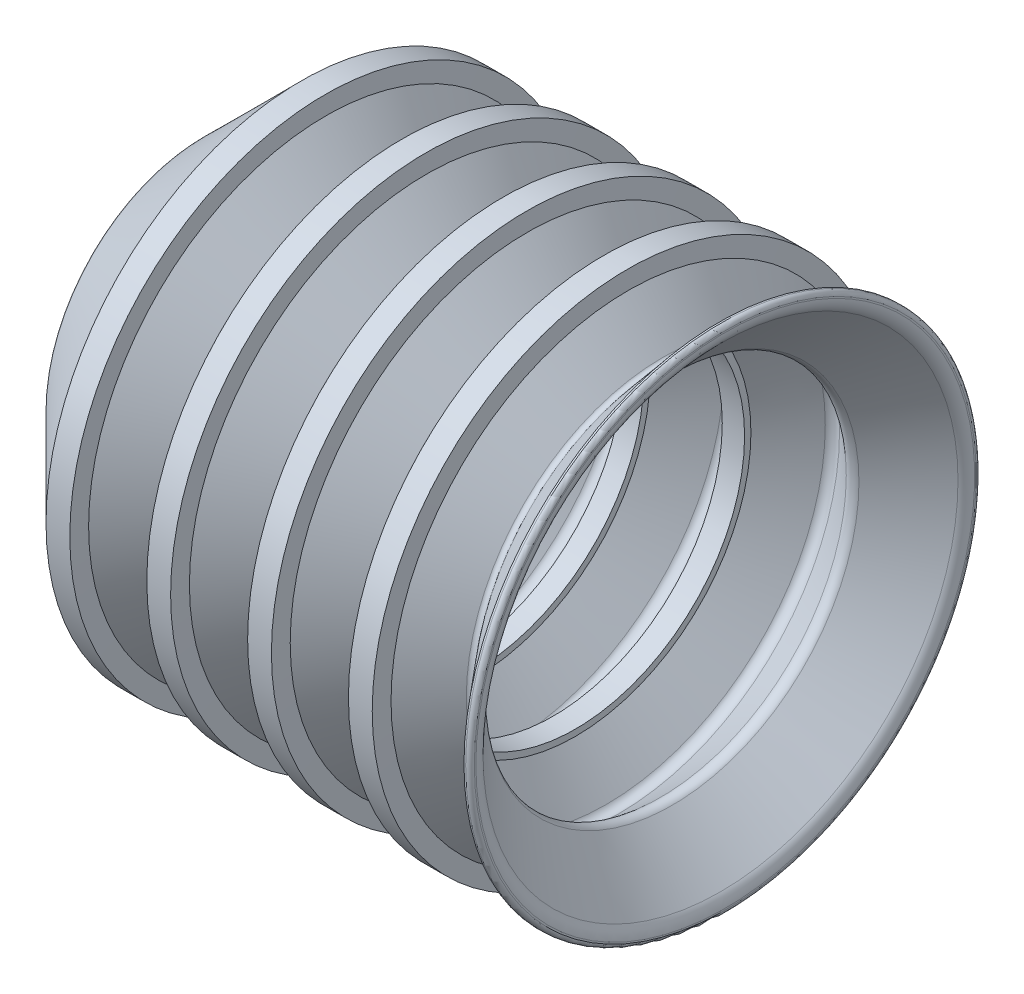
ISO-10303-21;
HEADER;
FILE_DESCRIPTION(('STEP AP214'),'2;1');
FILE_NAME('part.step','',(''),(''),'','','');
FILE_SCHEMA(('AUTOMOTIVE_DESIGN { 1 0 10303 214 1 1 1 1 }'));
ENDSEC;
DATA;
#1=APPLICATION_CONTEXT('core data for automotive mechanical design processes');
#2=APPLICATION_PROTOCOL_DEFINITION('international standard','automotive_design',2000,#1);
#3=PRODUCT_CONTEXT('',#1,'mechanical');
#4=PRODUCT('Part','Part','',(#3));
#5=PRODUCT_RELATED_PRODUCT_CATEGORY('part','',(#4));
#6=PRODUCT_DEFINITION_FORMATION('','',#4);
#7=PRODUCT_DEFINITION_CONTEXT('part definition',#1,'design');
#8=PRODUCT_DEFINITION('design','',#6,#7);
#9=PRODUCT_DEFINITION_SHAPE('','',#8);
#10=(LENGTH_UNIT() NAMED_UNIT(*) SI_UNIT(.MILLI.,.METRE.));
#11=(NAMED_UNIT(*) PLANE_ANGLE_UNIT() SI_UNIT($,.RADIAN.));
#12=(NAMED_UNIT(*) SI_UNIT($,.STERADIAN.) SOLID_ANGLE_UNIT());
#13=UNCERTAINTY_MEASURE_WITH_UNIT(LENGTH_MEASURE(1.E-05),#10,'distance_accuracy_value','');
#14=(GEOMETRIC_REPRESENTATION_CONTEXT(3) GLOBAL_UNCERTAINTY_ASSIGNED_CONTEXT((#13)) GLOBAL_UNIT_ASSIGNED_CONTEXT((#10,
#11,#12)) REPRESENTATION_CONTEXT('',''));
#15=CARTESIAN_POINT('',(0.,0.,0.));
#16=DIRECTION('',(0.,0.,1.));
#17=DIRECTION('',(1.,0.,0.));
#18=AXIS2_PLACEMENT_3D('',#15,#16,#17);
#19=CARTESIAN_POINT('',(30.861,14.732,0.));
#20=DIRECTION('',(-1.,0.,0.));
#21=DIRECTION('',(0.,0.,1.));
#22=AXIS2_PLACEMENT_3D('',#19,#20,#21);
#23=PLANE('',#22);
#24=CARTESIAN_POINT('',(30.861,0.,0.));
#25=DIRECTION('',(-1.,0.,0.));
#26=DIRECTION('',(0.,0.,1.));
#27=AXIS2_PLACEMENT_3D('',#24,#25,#26);
#28=CIRCLE('',#27,14.6428122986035);
#29=CARTESIAN_POINT('',(30.861,0.,14.6428122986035));
#30=VERTEX_POINT('',#29);
#31=EDGE_CURVE('E248',#30,#30,#28,.T.);
#32=ORIENTED_EDGE('',*,*,#31,.T.);
#33=EDGE_LOOP('',(#32));
#34=FACE_BOUND('',#33,.T.);
#35=CARTESIAN_POINT('',(30.861,0.,0.));
#36=DIRECTION('',(-1.,0.,0.));
#37=DIRECTION('',(0.,0.,1.));
#38=AXIS2_PLACEMENT_3D('',#35,#36,#37);
#39=CIRCLE('',#38,14.732);
#40=CARTESIAN_POINT('',(30.861,0.,14.732));
#41=VERTEX_POINT('',#40);
#42=EDGE_CURVE('E62',#41,#41,#39,.T.);
#43=ORIENTED_EDGE('',*,*,#42,.F.);
#44=EDGE_LOOP('',(#43));
#45=FACE_BOUND('',#44,.T.);
#46=ADVANCED_FACE('F14',(#34,#45),#23,.F.);
#47=CARTESIAN_POINT('',(30.607,0.,0.));
#48=DIRECTION('',(-1.,0.,0.));
#49=DIRECTION('',(0.,0.,1.));
#50=AXIS2_PLACEMENT_3D('',#47,#48,#49);
#51=TOROIDAL_SURFACE('',#50,14.732,0.254000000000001);
#52=CARTESIAN_POINT('',(30.607,0.,0.));
#53=DIRECTION('',(-1.,0.,0.));
#54=DIRECTION('',(0.,0.,1.));
#55=AXIS2_PLACEMENT_3D('',#52,#53,#54);
#56=CIRCLE('',#55,14.986);
#57=CARTESIAN_POINT('',(30.607,0.,14.986));
#58=VERTEX_POINT('',#57);
#59=EDGE_CURVE('E66',#58,#58,#56,.T.);
#60=ORIENTED_EDGE('',*,*,#59,.F.);
#61=EDGE_LOOP('',(#60));
#62=FACE_BOUND('',#61,.T.);
#63=ORIENTED_EDGE('',*,*,#42,.T.);
#64=EDGE_LOOP('',(#63));
#65=FACE_BOUND('',#64,.T.);
#66=ADVANCED_FACE('F307',(#62,#65),#51,.T.);
#67=CARTESIAN_POINT('',(0.,0.,0.));
#68=DIRECTION('',(-1.,0.,0.));
#69=DIRECTION('',(0.,0.,1.));
#70=AXIS2_PLACEMENT_3D('',#67,#68,#69);
#71=CYLINDRICAL_SURFACE('',#70,14.986);
#72=CARTESIAN_POINT('',(30.5054,0.,0.));
#73=DIRECTION('',(-1.,0.,0.));
#74=DIRECTION('',(0.,0.,1.));
#75=AXIS2_PLACEMENT_3D('',#72,#73,#74);
#76=CIRCLE('',#75,14.986);
#77=CARTESIAN_POINT('',(30.5054,0.,14.986));
#78=VERTEX_POINT('',#77);
#79=EDGE_CURVE('E70',#78,#78,#76,.T.);
#80=ORIENTED_EDGE('',*,*,#79,.F.);
#81=EDGE_LOOP('',(#80));
#82=FACE_BOUND('',#81,.T.);
#83=ORIENTED_EDGE('',*,*,#59,.T.);
#84=EDGE_LOOP('',(#83));
#85=FACE_BOUND('',#84,.T.);
#86=ADVANCED_FACE('F313',(#82,#85),#71,.T.);
#87=CARTESIAN_POINT('',(30.5054,0.,0.));
#88=DIRECTION('',(1.,0.,0.));
#89=DIRECTION('',(0.,0.,-1.));
#90=AXIS2_PLACEMENT_3D('',#87,#88,#89);
#91=CONICAL_SURFACE('',#90,14.986,0.867428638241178);
#92=CARTESIAN_POINT('',(27.5729883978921,0.,0.));
#93=DIRECTION('',(1.,0.,0.));
#94=DIRECTION('',(0.,0.,-1.));
#95=AXIS2_PLACEMENT_3D('',#92,#93,#94);
#96=CIRCLE('',#95,11.5282189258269);
#97=CARTESIAN_POINT('',(27.5729883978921,0.,-11.5282189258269));
#98=VERTEX_POINT('',#97);
#99=EDGE_CURVE('E54',#98,#98,#96,.T.);
#100=ORIENTED_EDGE('',*,*,#99,.T.);
#101=EDGE_LOOP('',(#100));
#102=FACE_BOUND('',#101,.T.);
#103=ORIENTED_EDGE('',*,*,#79,.T.);
#104=EDGE_LOOP('',(#103));
#105=FACE_BOUND('',#104,.T.);
#106=ADVANCED_FACE('F360',(#102,#105),#91,.T.);
#107=CARTESIAN_POINT('',(27.3792706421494,0.,0.));
#108=DIRECTION('',(-1.,0.,0.));
#109=DIRECTION('',(0.,0.,1.));
#110=AXIS2_PLACEMENT_3D('',#107,#108,#109);
#111=CONICAL_SURFACE('',#110,11.2997947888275,0.867428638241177);
#112=CARTESIAN_POINT('',(27.1855528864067,0.,0.));
#113=DIRECTION('',(-1.,0.,0.));
#114=DIRECTION('',(0.,0.,1.));
#115=AXIS2_PLACEMENT_3D('',#112,#113,#114);
#116=CIRCLE('',#115,11.5282189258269);
#117=CARTESIAN_POINT('',(27.1855528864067,0.,11.5282189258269));
#118=VERTEX_POINT('',#117);
#119=EDGE_CURVE('E58',#118,#118,#116,.T.);
#120=ORIENTED_EDGE('',*,*,#119,.T.);
#121=EDGE_LOOP('',(#120));
#122=FACE_BOUND('',#121,.T.);
#123=CARTESIAN_POINT('',(25.1578534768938,0.,0.));
#124=DIRECTION('',(-1.,0.,0.));
#125=DIRECTION('',(0.,0.,1.));
#126=AXIS2_PLACEMENT_3D('',#123,#124,#125);
#127=CIRCLE('',#126,13.9192);
#128=CARTESIAN_POINT('',(25.1578534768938,0.,13.9192));
#129=VERTEX_POINT('',#128);
#130=EDGE_CURVE('E74',#129,#129,#127,.T.);
#131=ORIENTED_EDGE('',*,*,#130,.F.);
#132=EDGE_LOOP('',(#131));
#133=FACE_BOUND('',#132,.T.);
#134=ADVANCED_FACE('F356',(#122,#133),#111,.T.);
#135=CARTESIAN_POINT('',(25.1578534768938,0.,0.));
#136=DIRECTION('',(-1.,0.,0.));
#137=DIRECTION('',(0.,0.,1.));
#138=AXIS2_PLACEMENT_3D('',#135,#136,#137);
#139=CONICAL_SURFACE('',#138,13.9192,1.53588974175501);
#140=CARTESIAN_POINT('',(25.1206,0.,0.));
#141=DIRECTION('',(-1.,0.,0.));
#142=DIRECTION('',(0.,0.,1.));
#143=AXIS2_PLACEMENT_3D('',#140,#141,#142);
#144=CIRCLE('',#143,14.986);
#145=CARTESIAN_POINT('',(25.1206,0.,14.986));
#146=VERTEX_POINT('',#145);
#147=EDGE_CURVE('E77',#146,#146,#144,.T.);
#148=ORIENTED_EDGE('',*,*,#147,.F.);
#149=EDGE_LOOP('',(#148));
#150=FACE_BOUND('',#149,.T.);
#151=ORIENTED_EDGE('',*,*,#130,.T.);
#152=EDGE_LOOP('',(#151));
#153=FACE_BOUND('',#152,.T.);
#154=ADVANCED_FACE('F359',(#150,#153),#139,.T.);
#155=CARTESIAN_POINT('',(0.,0.,0.));
#156=DIRECTION('',(-1.,0.,0.));
#157=DIRECTION('',(0.,0.,1.));
#158=AXIS2_PLACEMENT_3D('',#155,#156,#157);
#159=CYLINDRICAL_SURFACE('',#158,14.986);
#160=CARTESIAN_POINT('',(23.7236,0.,0.));
#161=DIRECTION('',(-1.,0.,0.));
#162=DIRECTION('',(0.,0.,1.));
#163=AXIS2_PLACEMENT_3D('',#160,#161,#162);
#164=CIRCLE('',#163,14.986);
#165=CARTESIAN_POINT('',(23.7236,0.,14.986));
#166=VERTEX_POINT('',#165);
#167=EDGE_CURVE('E81',#166,#166,#164,.T.);
#168=ORIENTED_EDGE('',*,*,#167,.F.);
#169=EDGE_LOOP('',(#168));
#170=FACE_BOUND('',#169,.T.);
#171=ORIENTED_EDGE('',*,*,#147,.T.);
#172=EDGE_LOOP('',(#171));
#173=FACE_BOUND('',#172,.T.);
#174=ADVANCED_FACE('F365',(#170,#173),#159,.T.);
#175=CARTESIAN_POINT('',(23.7236,0.,0.));
#176=DIRECTION('',(1.,0.,0.));
#177=DIRECTION('',(0.,0.,-1.));
#178=AXIS2_PLACEMENT_3D('',#175,#176,#177);
#179=CONICAL_SURFACE('',#178,14.986,1.53588974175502);
#180=CARTESIAN_POINT('',(23.6863465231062,0.,0.));
#181=DIRECTION('',(-1.,0.,0.));
#182=DIRECTION('',(0.,0.,1.));
#183=AXIS2_PLACEMENT_3D('',#180,#181,#182);
#184=CIRCLE('',#183,13.9192);
#185=CARTESIAN_POINT('',(23.6863465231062,0.,13.9192));
#186=VERTEX_POINT('',#185);
#187=EDGE_CURVE('E85',#186,#186,#184,.T.);
#188=ORIENTED_EDGE('',*,*,#187,.F.);
#189=EDGE_LOOP('',(#188));
#190=FACE_BOUND('',#189,.T.);
#191=ORIENTED_EDGE('',*,*,#167,.T.);
#192=EDGE_LOOP('',(#191));
#193=FACE_BOUND('',#192,.T.);
#194=ADVANCED_FACE('F372',(#190,#193),#179,.T.);
#195=CARTESIAN_POINT('',(23.6863465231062,0.,0.));
#196=DIRECTION('',(1.,0.,0.));
#197=DIRECTION('',(0.,0.,-1.));
#198=AXIS2_PLACEMENT_3D('',#195,#196,#197);
#199=CONICAL_SURFACE('',#198,13.9192,0.867428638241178);
#200=CARTESIAN_POINT('',(21.6567177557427,0.,0.));
#201=DIRECTION('',(1.,0.,0.));
#202=DIRECTION('',(0.,0.,-1.));
#203=AXIS2_PLACEMENT_3D('',#200,#201,#202);
#204=CIRCLE('',#203,11.5259439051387);
#205=CARTESIAN_POINT('',(21.6567177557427,0.,-11.5259439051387));
#206=VERTEX_POINT('',#205);
#207=EDGE_CURVE('E46',#206,#206,#204,.T.);
#208=ORIENTED_EDGE('',*,*,#207,.T.);
#209=EDGE_LOOP('',(#208));
#210=FACE_BOUND('',#209,.T.);
#211=ORIENTED_EDGE('',*,*,#187,.T.);
#212=EDGE_LOOP('',(#211));
#213=FACE_BOUND('',#212,.T.);
#214=ADVANCED_FACE('F434',(#210,#213),#199,.T.);
#215=CARTESIAN_POINT('',(21.463,0.,0.));
#216=DIRECTION('',(-1.,0.,0.));
#217=DIRECTION('',(0.,0.,1.));
#218=AXIS2_PLACEMENT_3D('',#215,#216,#217);
#219=CONICAL_SURFACE('',#218,11.2975197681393,0.867428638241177);
#220=CARTESIAN_POINT('',(21.2692822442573,0.,0.));
#221=DIRECTION('',(-1.,0.,0.));
#222=DIRECTION('',(0.,0.,1.));
#223=AXIS2_PLACEMENT_3D('',#220,#221,#222);
#224=CIRCLE('',#223,11.5259439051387);
#225=CARTESIAN_POINT('',(21.2692822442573,0.,11.5259439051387));
#226=VERTEX_POINT('',#225);
#227=EDGE_CURVE('E50',#226,#226,#224,.T.);
#228=ORIENTED_EDGE('',*,*,#227,.T.);
#229=EDGE_LOOP('',(#228));
#230=FACE_BOUND('',#229,.T.);
#231=CARTESIAN_POINT('',(19.2396534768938,0.,0.));
#232=DIRECTION('',(-1.,0.,0.));
#233=DIRECTION('',(0.,0.,1.));
#234=AXIS2_PLACEMENT_3D('',#231,#232,#233);
#235=CIRCLE('',#234,13.9192);
#236=CARTESIAN_POINT('',(19.2396534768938,0.,13.9192));
#237=VERTEX_POINT('',#236);
#238=EDGE_CURVE('E88',#237,#237,#235,.T.);
#239=ORIENTED_EDGE('',*,*,#238,.F.);
#240=EDGE_LOOP('',(#239));
#241=FACE_BOUND('',#240,.T.);
#242=ADVANCED_FACE('F442',(#230,#241),#219,.T.);
#243=CARTESIAN_POINT('',(19.2396534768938,0.,0.));
#244=DIRECTION('',(-1.,0.,0.));
#245=DIRECTION('',(0.,0.,1.));
#246=AXIS2_PLACEMENT_3D('',#243,#244,#245);
#247=CONICAL_SURFACE('',#246,13.9192,1.53588974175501);
#248=CARTESIAN_POINT('',(19.2024,0.,0.));
#249=DIRECTION('',(-1.,0.,0.));
#250=DIRECTION('',(0.,0.,1.));
#251=AXIS2_PLACEMENT_3D('',#248,#249,#250);
#252=CIRCLE('',#251,14.986);
#253=CARTESIAN_POINT('',(19.2024,0.,14.986));
#254=VERTEX_POINT('',#253);
#255=EDGE_CURVE('E92',#254,#254,#252,.T.);
#256=ORIENTED_EDGE('',*,*,#255,.F.);
#257=EDGE_LOOP('',(#256));
#258=FACE_BOUND('',#257,.T.);
#259=ORIENTED_EDGE('',*,*,#238,.T.);
#260=EDGE_LOOP('',(#259));
#261=FACE_BOUND('',#260,.T.);
#262=ADVANCED_FACE('F452',(#258,#261),#247,.T.);
#263=CARTESIAN_POINT('',(0.,0.,0.));
#264=DIRECTION('',(-1.,0.,0.));
#265=DIRECTION('',(0.,0.,1.));
#266=AXIS2_PLACEMENT_3D('',#263,#264,#265);
#267=CYLINDRICAL_SURFACE('',#266,14.986);
#268=CARTESIAN_POINT('',(17.8054,0.,0.));
#269=DIRECTION('',(-1.,0.,0.));
#270=DIRECTION('',(0.,0.,1.));
#271=AXIS2_PLACEMENT_3D('',#268,#269,#270);
#272=CIRCLE('',#271,14.986);
#273=CARTESIAN_POINT('',(17.8054,0.,14.986));
#274=VERTEX_POINT('',#273);
#275=EDGE_CURVE('E96',#274,#274,#272,.T.);
#276=ORIENTED_EDGE('',*,*,#275,.F.);
#277=EDGE_LOOP('',(#276));
#278=FACE_BOUND('',#277,.T.);
#279=ORIENTED_EDGE('',*,*,#255,.T.);
#280=EDGE_LOOP('',(#279));
#281=FACE_BOUND('',#280,.T.);
#282=ADVANCED_FACE('F463',(#278,#281),#267,.T.);
#283=CARTESIAN_POINT('',(17.8054,0.,0.));
#284=DIRECTION('',(1.,0.,0.));
#285=DIRECTION('',(0.,0.,-1.));
#286=AXIS2_PLACEMENT_3D('',#283,#284,#285);
#287=CONICAL_SURFACE('',#286,14.986,1.53588974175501);
#288=CARTESIAN_POINT('',(17.7681465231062,0.,0.));
#289=DIRECTION('',(-1.,0.,0.));
#290=DIRECTION('',(0.,0.,1.));
#291=AXIS2_PLACEMENT_3D('',#288,#289,#290);
#292=CIRCLE('',#291,13.9192);
#293=CARTESIAN_POINT('',(17.7681465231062,0.,13.9192));
#294=VERTEX_POINT('',#293);
#295=EDGE_CURVE('E100',#294,#294,#292,.T.);
#296=ORIENTED_EDGE('',*,*,#295,.F.);
#297=EDGE_LOOP('',(#296));
#298=FACE_BOUND('',#297,.T.);
#299=ORIENTED_EDGE('',*,*,#275,.T.);
#300=EDGE_LOOP('',(#299));
#301=FACE_BOUND('',#300,.T.);
#302=ADVANCED_FACE('F472',(#298,#301),#287,.T.);
#303=CARTESIAN_POINT('',(17.7681465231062,0.,0.));
#304=DIRECTION('',(1.,0.,0.));
#305=DIRECTION('',(0.,0.,-1.));
#306=AXIS2_PLACEMENT_3D('',#303,#304,#305);
#307=CONICAL_SURFACE('',#306,13.9192,0.867428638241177);
#308=CARTESIAN_POINT('',(15.7385177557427,0.,0.));
#309=DIRECTION('',(1.,0.,0.));
#310=DIRECTION('',(0.,0.,-1.));
#311=AXIS2_PLACEMENT_3D('',#308,#309,#310);
#312=CIRCLE('',#311,11.5259439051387);
#313=CARTESIAN_POINT('',(15.7385177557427,0.,-11.5259439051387));
#314=VERTEX_POINT('',#313);
#315=EDGE_CURVE('E31',#314,#314,#312,.T.);
#316=ORIENTED_EDGE('',*,*,#315,.T.);
#317=EDGE_LOOP('',(#316));
#318=FACE_BOUND('',#317,.T.);
#319=ORIENTED_EDGE('',*,*,#295,.T.);
#320=EDGE_LOOP('',(#319));
#321=FACE_BOUND('',#320,.T.);
#322=ADVANCED_FACE('F480',(#318,#321),#307,.T.);
#323=CARTESIAN_POINT('',(15.5448,0.,0.));
#324=DIRECTION('',(-1.,0.,0.));
#325=DIRECTION('',(0.,0.,1.));
#326=AXIS2_PLACEMENT_3D('',#323,#324,#325);
#327=CONICAL_SURFACE('',#326,11.2975197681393,0.867428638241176);
#328=CARTESIAN_POINT('',(15.3510822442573,0.,0.));
#329=DIRECTION('',(-1.,0.,0.));
#330=DIRECTION('',(0.,0.,1.));
#331=AXIS2_PLACEMENT_3D('',#328,#329,#330);
#332=CIRCLE('',#331,11.5259439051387);
#333=CARTESIAN_POINT('',(15.3510822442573,0.,11.5259439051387));
#334=VERTEX_POINT('',#333);
#335=EDGE_CURVE('E40',#334,#334,#332,.T.);
#336=ORIENTED_EDGE('',*,*,#335,.T.);
#337=EDGE_LOOP('',(#336));
#338=FACE_BOUND('',#337,.T.);
#339=CARTESIAN_POINT('',(13.3214534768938,0.,0.));
#340=DIRECTION('',(-1.,0.,0.));
#341=DIRECTION('',(0.,0.,1.));
#342=AXIS2_PLACEMENT_3D('',#339,#340,#341);
#343=CIRCLE('',#342,13.9192);
#344=CARTESIAN_POINT('',(13.3214534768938,0.,13.9192));
#345=VERTEX_POINT('',#344);
#346=EDGE_CURVE('E104',#345,#345,#343,.T.);
#347=ORIENTED_EDGE('',*,*,#346,.F.);
#348=EDGE_LOOP('',(#347));
#349=FACE_BOUND('',#348,.T.);
#350=ADVANCED_FACE('F488',(#338,#349),#327,.T.);
#351=CARTESIAN_POINT('',(13.3214534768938,0.,0.));
#352=DIRECTION('',(-1.,0.,0.));
#353=DIRECTION('',(0.,0.,1.));
#354=AXIS2_PLACEMENT_3D('',#351,#352,#353);
#355=CONICAL_SURFACE('',#354,13.9192,1.53588974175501);
#356=CARTESIAN_POINT('',(13.2842,0.,0.));
#357=DIRECTION('',(-1.,0.,0.));
#358=DIRECTION('',(0.,0.,1.));
#359=AXIS2_PLACEMENT_3D('',#356,#357,#358);
#360=CIRCLE('',#359,14.986);
#361=CARTESIAN_POINT('',(13.2842,0.,14.986));
#362=VERTEX_POINT('',#361);
#363=EDGE_CURVE('E108',#362,#362,#360,.T.);
#364=ORIENTED_EDGE('',*,*,#363,.F.);
#365=EDGE_LOOP('',(#364));
#366=FACE_BOUND('',#365,.T.);
#367=ORIENTED_EDGE('',*,*,#346,.T.);
#368=EDGE_LOOP('',(#367));
#369=FACE_BOUND('',#368,.T.);
#370=ADVANCED_FACE('F497',(#366,#369),#355,.T.);
#371=CARTESIAN_POINT('',(0.,0.,0.));
#372=DIRECTION('',(-1.,0.,0.));
#373=DIRECTION('',(0.,0.,1.));
#374=AXIS2_PLACEMENT_3D('',#371,#372,#373);
#375=CYLINDRICAL_SURFACE('',#374,14.986);
#376=CARTESIAN_POINT('',(11.8872,0.,0.));
#377=DIRECTION('',(-1.,0.,0.));
#378=DIRECTION('',(0.,0.,1.));
#379=AXIS2_PLACEMENT_3D('',#376,#377,#378);
#380=CIRCLE('',#379,14.986);
#381=CARTESIAN_POINT('',(11.8872,0.,14.986));
#382=VERTEX_POINT('',#381);
#383=EDGE_CURVE('E112',#382,#382,#380,.T.);
#384=ORIENTED_EDGE('',*,*,#383,.F.);
#385=EDGE_LOOP('',(#384));
#386=FACE_BOUND('',#385,.T.);
#387=ORIENTED_EDGE('',*,*,#363,.T.);
#388=EDGE_LOOP('',(#387));
#389=FACE_BOUND('',#388,.T.);
#390=ADVANCED_FACE('F506',(#386,#389),#375,.T.);
#391=CARTESIAN_POINT('',(11.8872,0.,0.));
#392=DIRECTION('',(1.,0.,0.));
#393=DIRECTION('',(0.,0.,-1.));
#394=AXIS2_PLACEMENT_3D('',#391,#392,#393);
#395=CONICAL_SURFACE('',#394,14.986,1.53588974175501);
#396=CARTESIAN_POINT('',(11.8499465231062,0.,0.));
#397=DIRECTION('',(-1.,0.,0.));
#398=DIRECTION('',(0.,0.,1.));
#399=AXIS2_PLACEMENT_3D('',#396,#397,#398);
#400=CIRCLE('',#399,13.9192);
#401=CARTESIAN_POINT('',(11.8499465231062,0.,13.9192));
#402=VERTEX_POINT('',#401);
#403=EDGE_CURVE('E116',#402,#402,#400,.T.);
#404=ORIENTED_EDGE('',*,*,#403,.F.);
#405=EDGE_LOOP('',(#404));
#406=FACE_BOUND('',#405,.T.);
#407=ORIENTED_EDGE('',*,*,#383,.T.);
#408=EDGE_LOOP('',(#407));
#409=FACE_BOUND('',#408,.T.);
#410=ADVANCED_FACE('F304',(#406,#409),#395,.T.);
#411=CARTESIAN_POINT('',(11.8499465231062,0.,0.));
#412=DIRECTION('',(1.,0.,0.));
#413=DIRECTION('',(0.,0.,-1.));
#414=AXIS2_PLACEMENT_3D('',#411,#412,#413);
#415=CONICAL_SURFACE('',#414,13.9192,0.867428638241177);
#416=CARTESIAN_POINT('',(9.82031775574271,0.,0.));
#417=DIRECTION('',(1.,0.,0.));
#418=DIRECTION('',(0.,0.,-1.));
#419=AXIS2_PLACEMENT_3D('',#416,#417,#418);
#420=CIRCLE('',#419,11.5259439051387);
#421=CARTESIAN_POINT('',(9.82031775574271,0.,-11.5259439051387));
#422=VERTEX_POINT('',#421);
#423=EDGE_CURVE('E9',#422,#422,#420,.T.);
#424=ORIENTED_EDGE('',*,*,#423,.T.);
#425=EDGE_LOOP('',(#424));
#426=FACE_BOUND('',#425,.T.);
#427=ORIENTED_EDGE('',*,*,#403,.T.);
#428=EDGE_LOOP('',(#427));
#429=FACE_BOUND('',#428,.T.);
#430=ADVANCED_FACE('F297',(#426,#429),#415,.T.);
#431=CARTESIAN_POINT('',(9.6266,0.,0.));
#432=DIRECTION('',(-1.,0.,0.));
#433=DIRECTION('',(0.,0.,1.));
#434=AXIS2_PLACEMENT_3D('',#431,#432,#433);
#435=CONICAL_SURFACE('',#434,11.2975197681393,0.867428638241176);
#436=CARTESIAN_POINT('',(9.43288224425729,0.,0.));
#437=DIRECTION('',(-1.,0.,0.));
#438=DIRECTION('',(0.,0.,1.));
#439=AXIS2_PLACEMENT_3D('',#436,#437,#438);
#440=CIRCLE('',#439,11.5259439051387);
#441=CARTESIAN_POINT('',(9.43288224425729,0.,11.5259439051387));
#442=VERTEX_POINT('',#441);
#443=EDGE_CURVE('E21',#442,#442,#440,.T.);
#444=ORIENTED_EDGE('',*,*,#443,.T.);
#445=EDGE_LOOP('',(#444));
#446=FACE_BOUND('',#445,.T.);
#447=CARTESIAN_POINT('',(7.40325347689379,0.,0.));
#448=DIRECTION('',(-1.,0.,0.));
#449=DIRECTION('',(0.,0.,1.));
#450=AXIS2_PLACEMENT_3D('',#447,#448,#449);
#451=CIRCLE('',#450,13.9192);
#452=CARTESIAN_POINT('',(7.40325347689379,0.,13.9192));
#453=VERTEX_POINT('',#452);
#454=EDGE_CURVE('E120',#453,#453,#451,.T.);
#455=ORIENTED_EDGE('',*,*,#454,.F.);
#456=EDGE_LOOP('',(#455));
#457=FACE_BOUND('',#456,.T.);
#458=ADVANCED_FACE('F292',(#446,#457),#435,.T.);
#459=CARTESIAN_POINT('',(7.40325347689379,0.,0.));
#460=DIRECTION('',(-1.,0.,0.));
#461=DIRECTION('',(0.,0.,1.));
#462=AXIS2_PLACEMENT_3D('',#459,#460,#461);
#463=CONICAL_SURFACE('',#462,13.9192,1.53588974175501);
#464=CARTESIAN_POINT('',(7.36599999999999,0.,0.));
#465=DIRECTION('',(-1.,0.,0.));
#466=DIRECTION('',(0.,0.,1.));
#467=AXIS2_PLACEMENT_3D('',#464,#465,#466);
#468=CIRCLE('',#467,14.986);
#469=CARTESIAN_POINT('',(7.36599999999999,0.,14.986));
#470=VERTEX_POINT('',#469);
#471=EDGE_CURVE('E124',#470,#470,#468,.T.);
#472=ORIENTED_EDGE('',*,*,#471,.F.);
#473=EDGE_LOOP('',(#472));
#474=FACE_BOUND('',#473,.T.);
#475=ORIENTED_EDGE('',*,*,#454,.T.);
#476=EDGE_LOOP('',(#475));
#477=FACE_BOUND('',#476,.T.);
#478=ADVANCED_FACE('F286',(#474,#477),#463,.T.);
#479=CARTESIAN_POINT('',(0.,0.,0.));
#480=DIRECTION('',(-1.,0.,0.));
#481=DIRECTION('',(0.,0.,1.));
#482=AXIS2_PLACEMENT_3D('',#479,#480,#481);
#483=CYLINDRICAL_SURFACE('',#482,14.986);
#484=CARTESIAN_POINT('',(5.969,0.,0.));
#485=DIRECTION('',(-1.,0.,0.));
#486=DIRECTION('',(0.,0.,1.));
#487=AXIS2_PLACEMENT_3D('',#484,#485,#486);
#488=CIRCLE('',#487,14.986);
#489=CARTESIAN_POINT('',(5.969,0.,14.986));
#490=VERTEX_POINT('',#489);
#491=EDGE_CURVE('E128',#490,#490,#488,.T.);
#492=ORIENTED_EDGE('',*,*,#491,.F.);
#493=EDGE_LOOP('',(#492));
#494=FACE_BOUND('',#493,.T.);
#495=ORIENTED_EDGE('',*,*,#471,.T.);
#496=EDGE_LOOP('',(#495));
#497=FACE_BOUND('',#496,.T.);
#498=ADVANCED_FACE('F280',(#494,#497),#483,.T.);
#499=CARTESIAN_POINT('',(5.969,0.,0.));
#500=DIRECTION('',(1.,0.,0.));
#501=DIRECTION('',(0.,0.,-1.));
#502=AXIS2_PLACEMENT_3D('',#499,#500,#501);
#503=CONICAL_SURFACE('',#502,14.986,0.785398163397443);
#504=CARTESIAN_POINT('',(0.304376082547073,0.,0.));
#505=DIRECTION('',(-1.,0.,0.));
#506=DIRECTION('',(0.,0.,1.));
#507=AXIS2_PLACEMENT_3D('',#504,#505,#506);
#508=CIRCLE('',#507,9.32137608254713);
#509=CARTESIAN_POINT('',(0.304376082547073,0.,9.32137608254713));
#510=VERTEX_POINT('',#509);
#511=EDGE_CURVE('E132',#510,#510,#508,.T.);
#512=ORIENTED_EDGE('',*,*,#511,.F.);
#513=EDGE_LOOP('',(#512));
#514=FACE_BOUND('',#513,.T.);
#515=ORIENTED_EDGE('',*,*,#491,.T.);
#516=EDGE_LOOP('',(#515));
#517=FACE_BOUND('',#516,.T.);
#518=ADVANCED_FACE('F274',(#514,#517),#503,.T.);
#519=CARTESIAN_POINT('',(1.0392049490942,0.,0.));
#520=DIRECTION('',(-1.,0.,0.));
#521=DIRECTION('',(0.,0.,1.));
#522=AXIS2_PLACEMENT_3D('',#519,#520,#521);
#523=TOROIDAL_SURFACE('',#522,8.586547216,1.0392049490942);
#524=CARTESIAN_POINT('',(0.,0.,0.));
#525=DIRECTION('',(-1.,0.,0.));
#526=DIRECTION('',(0.,0.,1.));
#527=AXIS2_PLACEMENT_3D('',#524,#525,#526);
#528=CIRCLE('',#527,8.586547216);
#529=CARTESIAN_POINT('',(0.,0.,8.586547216));
#530=VERTEX_POINT('',#529);
#531=EDGE_CURVE('E136',#530,#530,#528,.T.);
#532=ORIENTED_EDGE('',*,*,#531,.F.);
#533=EDGE_LOOP('',(#532));
#534=FACE_BOUND('',#533,.T.);
#535=ORIENTED_EDGE('',*,*,#511,.T.);
#536=EDGE_LOOP('',(#535));
#537=FACE_BOUND('',#536,.T.);
#538=ADVANCED_FACE('F268',(#534,#537),#523,.T.);
#539=CARTESIAN_POINT('',(0.,0.,0.));
#540=DIRECTION('',(1.,0.,0.));
#541=DIRECTION('',(0.,0.,-1.));
#542=AXIS2_PLACEMENT_3D('',#539,#540,#541);
#543=PLANE('',#542);
#544=CARTESIAN_POINT('',(0.,0.,0.));
#545=DIRECTION('',(-1.,0.,0.));
#546=DIRECTION('',(0.,0.,1.));
#547=AXIS2_PLACEMENT_3D('',#544,#545,#546);
#548=CIRCLE('',#547,3.4163);
#549=CARTESIAN_POINT('',(0.,0.,3.4163));
#550=VERTEX_POINT('',#549);
#551=EDGE_CURVE('E252',#550,#550,#548,.T.);
#552=ORIENTED_EDGE('',*,*,#551,.F.);
#553=EDGE_LOOP('',(#552));
#554=FACE_BOUND('',#553,.T.);
#555=ORIENTED_EDGE('',*,*,#531,.T.);
#556=EDGE_LOOP('',(#555));
#557=FACE_BOUND('',#556,.T.);
#558=ADVANCED_FACE('F264',(#554,#557),#543,.F.);
#559=CARTESIAN_POINT('',(27.3792706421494,0.,0.));
#560=DIRECTION('',(-1.,0.,0.));
#561=DIRECTION('',(0.,0.,1.));
#562=AXIS2_PLACEMENT_3D('',#559,#560,#561);
#563=TOROIDAL_SURFACE('',#562,11.6925035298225,0.254);
#564=ORIENTED_EDGE('',*,*,#99,.F.);
#565=EDGE_LOOP('',(#564));
#566=FACE_BOUND('',#565,.T.);
#567=ORIENTED_EDGE('',*,*,#119,.F.);
#568=EDGE_LOOP('',(#567));
#569=FACE_BOUND('',#568,.T.);
#570=ADVANCED_FACE('F267',(#566,#569),#563,.F.);
#571=CARTESIAN_POINT('',(21.463,0.,0.));
#572=DIRECTION('',(-1.,0.,0.));
#573=DIRECTION('',(0.,0.,1.));
#574=AXIS2_PLACEMENT_3D('',#571,#572,#573);
#575=TOROIDAL_SURFACE('',#574,11.6902285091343,0.254);
#576=ORIENTED_EDGE('',*,*,#207,.F.);
#577=EDGE_LOOP('',(#576));
#578=FACE_BOUND('',#577,.T.);
#579=ORIENTED_EDGE('',*,*,#227,.F.);
#580=EDGE_LOOP('',(#579));
#581=FACE_BOUND('',#580,.T.);
#582=ADVANCED_FACE('F342',(#578,#581),#575,.F.);
#583=CARTESIAN_POINT('',(15.5448,0.,0.));
#584=DIRECTION('',(-1.,0.,0.));
#585=DIRECTION('',(0.,0.,1.));
#586=AXIS2_PLACEMENT_3D('',#583,#584,#585);
#587=TOROIDAL_SURFACE('',#586,11.6902285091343,0.254);
#588=ORIENTED_EDGE('',*,*,#315,.F.);
#589=EDGE_LOOP('',(#588));
#590=FACE_BOUND('',#589,.T.);
#591=ORIENTED_EDGE('',*,*,#335,.F.);
#592=EDGE_LOOP('',(#591));
#593=FACE_BOUND('',#592,.T.);
#594=ADVANCED_FACE('F334',(#590,#593),#587,.F.);
#595=CARTESIAN_POINT('',(9.6266,0.,0.));
#596=DIRECTION('',(-1.,0.,0.));
#597=DIRECTION('',(0.,0.,1.));
#598=AXIS2_PLACEMENT_3D('',#595,#596,#597);
#599=TOROIDAL_SURFACE('',#598,11.6902285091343,0.254);
#600=ORIENTED_EDGE('',*,*,#423,.F.);
#601=EDGE_LOOP('',(#600));
#602=FACE_BOUND('',#601,.T.);
#603=ORIENTED_EDGE('',*,*,#443,.F.);
#604=EDGE_LOOP('',(#603));
#605=FACE_BOUND('',#604,.T.);
#606=ADVANCED_FACE('F323',(#602,#605),#599,.F.);
#607=CARTESIAN_POINT('',(29.845,0.,0.));
#608=DIRECTION('',(-1.,0.,0.));
#609=DIRECTION('',(0.,0.,1.));
#610=AXIS2_PLACEMENT_3D('',#607,#608,#609);
#611=TOROIDAL_SURFACE('',#610,14.6428122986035,1.016);
#612=CARTESIAN_POINT('',(30.5814486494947,0.,0.));
#613=DIRECTION('',(1.,0.,0.));
#614=DIRECTION('',(0.,0.,-1.));
#615=AXIS2_PLACEMENT_3D('',#612,#613,#614);
#616=CIRCLE('',#615,13.9428841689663);
#617=CARTESIAN_POINT('',(30.5814486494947,0.,-13.9428841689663));
#618=VERTEX_POINT('',#617);
#619=EDGE_CURVE('E140',#618,#618,#616,.T.);
#620=ORIENTED_EDGE('',*,*,#619,.F.);
#621=EDGE_LOOP('',(#620));
#622=FACE_BOUND('',#621,.T.);
#623=ORIENTED_EDGE('',*,*,#31,.F.);
#624=EDGE_LOOP('',(#623));
#625=FACE_BOUND('',#624,.T.);
#626=ADVANCED_FACE('F320',(#622,#625),#611,.T.);
#627=CARTESIAN_POINT('',(30.861,0.,0.));
#628=DIRECTION('',(1.,0.,0.));
#629=DIRECTION('',(0.,0.,-1.));
#630=AXIS2_PLACEMENT_3D('',#627,#628,#629);
#631=CONICAL_SURFACE('',#630,14.237021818,0.810818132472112);
#632=ORIENTED_EDGE('',*,*,#619,.T.);
#633=EDGE_LOOP('',(#632));
#634=FACE_BOUND('',#633,.T.);
#635=CARTESIAN_POINT('',(27.7483158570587,0.,0.));
#636=DIRECTION('',(-1.,0.,0.));
#637=DIRECTION('',(0.,0.,1.));
#638=AXIS2_PLACEMENT_3D('',#635,#636,#637);
#639=CIRCLE('',#638,10.9619255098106);
#640=CARTESIAN_POINT('',(27.7483158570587,0.,10.9619255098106));
#641=VERTEX_POINT('',#640);
#642=EDGE_CURVE('E144',#641,#641,#639,.T.);
#643=ORIENTED_EDGE('',*,*,#642,.T.);
#644=EDGE_LOOP('',(#643));
#645=FACE_BOUND('',#644,.T.);
#646=ADVANCED_FACE('F322',(#634,#645),#631,.F.);
#647=CARTESIAN_POINT('',(27.3747256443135,0.,0.));
#648=DIRECTION('',(-1.,0.,0.));
#649=DIRECTION('',(0.,0.,1.));
#650=AXIS2_PLACEMENT_3D('',#647,#648,#649);
#651=TOROIDAL_SURFACE('',#650,11.316989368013,0.515402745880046);
#652=CARTESIAN_POINT('',(27.0438891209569,0.,0.));
#653=DIRECTION('',(-1.,0.,0.));
#654=DIRECTION('',(0.,0.,1.));
#655=AXIS2_PLACEMENT_3D('',#652,#653,#654);
#656=CIRCLE('',#655,10.9217841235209);
#657=CARTESIAN_POINT('',(27.0438891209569,0.,10.9217841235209));
#658=VERTEX_POINT('',#657);
#659=EDGE_CURVE('E148',#658,#658,#656,.T.);
#660=ORIENTED_EDGE('',*,*,#659,.T.);
#661=EDGE_LOOP('',(#660));
#662=FACE_BOUND('',#661,.T.);
#663=ORIENTED_EDGE('',*,*,#642,.F.);
#664=EDGE_LOOP('',(#663));
#665=FACE_BOUND('',#664,.T.);
#666=ADVANCED_FACE('F331',(#662,#665),#651,.T.);
#667=CARTESIAN_POINT('',(27.0438891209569,0.,0.));
#668=DIRECTION('',(-1.,0.,0.));
#669=DIRECTION('',(0.,0.,1.));
#670=AXIS2_PLACEMENT_3D('',#667,#668,#669);
#671=CONICAL_SURFACE('',#670,10.9217841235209,0.696972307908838);
#672=CARTESIAN_POINT('',(24.6113955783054,0.,0.));
#673=DIRECTION('',(-1.,0.,0.));
#674=DIRECTION('',(0.,0.,1.));
#675=AXIS2_PLACEMENT_3D('',#672,#673,#674);
#676=CIRCLE('',#675,12.9580873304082);
#677=CARTESIAN_POINT('',(24.6113955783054,0.,12.9580873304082));
#678=VERTEX_POINT('',#677);
#679=EDGE_CURVE('E152',#678,#678,#676,.T.);
#680=ORIENTED_EDGE('',*,*,#679,.T.);
#681=EDGE_LOOP('',(#680));
#682=FACE_BOUND('',#681,.T.);
#683=ORIENTED_EDGE('',*,*,#659,.F.);
#684=EDGE_LOOP('',(#683));
#685=FACE_BOUND('',#684,.T.);
#686=ADVANCED_FACE('F813',(#682,#685),#671,.F.);
#687=CARTESIAN_POINT('',(24.2853108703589,0.,0.));
#688=DIRECTION('',(-1.,0.,0.));
#689=DIRECTION('',(0.,0.,1.));
#690=AXIS2_PLACEMENT_3D('',#687,#688,#689);
#691=TOROIDAL_SURFACE('',#690,12.5685584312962,0.507999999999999);
#692=CARTESIAN_POINT('',(23.8702665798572,0.,0.));
#693=DIRECTION('',(-1.,0.,0.));
#694=DIRECTION('',(0.,0.,1.));
#695=AXIS2_PLACEMENT_3D('',#692,#693,#694);
#696=CIRCLE('',#695,12.8614786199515);
#697=CARTESIAN_POINT('',(23.8702665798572,0.,12.8614786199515));
#698=VERTEX_POINT('',#697);
#699=EDGE_CURVE('E156',#698,#698,#696,.T.);
#700=ORIENTED_EDGE('',*,*,#699,.T.);
#701=EDGE_LOOP('',(#700));
#702=FACE_BOUND('',#701,.T.);
#703=ORIENTED_EDGE('',*,*,#679,.F.);
#704=EDGE_LOOP('',(#703));
#705=FACE_BOUND('',#704,.T.);
#706=ADVANCED_FACE('F826',(#702,#705),#691,.F.);
#707=CARTESIAN_POINT('',(23.8702665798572,0.,0.));
#708=DIRECTION('',(1.,0.,0.));
#709=DIRECTION('',(0.,0.,-1.));
#710=AXIS2_PLACEMENT_3D('',#707,#708,#709);
#711=CONICAL_SURFACE('',#710,12.8614786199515,0.956217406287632);
#712=CARTESIAN_POINT('',(22.0647478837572,0.,0.));
#713=DIRECTION('',(-1.,0.,0.));
#714=DIRECTION('',(0.,0.,1.));
#715=AXIS2_PLACEMENT_3D('',#712,#713,#714);
#716=CIRCLE('',#715,10.3032041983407);
#717=CARTESIAN_POINT('',(22.0647478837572,0.,10.3032041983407));
#718=VERTEX_POINT('',#717);
#719=EDGE_CURVE('E160',#718,#718,#716,.T.);
#720=ORIENTED_EDGE('',*,*,#719,.T.);
#721=EDGE_LOOP('',(#720));
#722=FACE_BOUND('',#721,.T.);
#723=ORIENTED_EDGE('',*,*,#699,.F.);
#724=EDGE_LOOP('',(#723));
#725=FACE_BOUND('',#724,.T.);
#726=ADVANCED_FACE('F836',(#722,#725),#711,.F.);
#727=CARTESIAN_POINT('',(22.0647478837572,9.93139999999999,0.));
#728=DIRECTION('',(1.,0.,0.));
#729=DIRECTION('',(0.,0.,-1.));
#730=AXIS2_PLACEMENT_3D('',#727,#728,#729);
#731=PLANE('',#730);
#732=CARTESIAN_POINT('',(22.0647478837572,0.,0.));
#733=DIRECTION('',(-1.,0.,0.));
#734=DIRECTION('',(0.,0.,1.));
#735=AXIS2_PLACEMENT_3D('',#732,#733,#734);
#736=CIRCLE('',#735,9.93139999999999);
#737=CARTESIAN_POINT('',(22.0647478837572,0.,9.93139999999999));
#738=VERTEX_POINT('',#737);
#739=EDGE_CURVE('E164',#738,#738,#736,.T.);
#740=ORIENTED_EDGE('',*,*,#739,.T.);
#741=EDGE_LOOP('',(#740));
#742=FACE_BOUND('',#741,.T.);
#743=ORIENTED_EDGE('',*,*,#719,.F.);
#744=EDGE_LOOP('',(#743));
#745=FACE_BOUND('',#744,.T.);
#746=ADVANCED_FACE('F847',(#742,#745),#731,.T.);
#747=CARTESIAN_POINT('',(0.,0.,0.));
#748=DIRECTION('',(-1.,0.,0.));
#749=DIRECTION('',(0.,0.,1.));
#750=AXIS2_PLACEMENT_3D('',#747,#748,#749);
#751=CYLINDRICAL_SURFACE('',#750,9.93139999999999);
#752=CARTESIAN_POINT('',(20.7541412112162,0.,0.));
#753=DIRECTION('',(-1.,0.,0.));
#754=DIRECTION('',(0.,0.,1.));
#755=AXIS2_PLACEMENT_3D('',#752,#753,#754);
#756=CIRCLE('',#755,9.93139999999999);
#757=CARTESIAN_POINT('',(20.7541412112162,0.,9.93139999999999));
#758=VERTEX_POINT('',#757);
#759=EDGE_CURVE('E168',#758,#758,#756,.T.);
#760=ORIENTED_EDGE('',*,*,#759,.T.);
#761=EDGE_LOOP('',(#760));
#762=FACE_BOUND('',#761,.T.);
#763=ORIENTED_EDGE('',*,*,#739,.F.);
#764=EDGE_LOOP('',(#763));
#765=FACE_BOUND('',#764,.T.);
#766=ADVANCED_FACE('F857',(#762,#765),#751,.F.);
#767=CARTESIAN_POINT('',(20.7541412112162,9.93139999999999,0.));
#768=DIRECTION('',(-1.,0.,0.));
#769=DIRECTION('',(0.,0.,1.));
#770=AXIS2_PLACEMENT_3D('',#767,#768,#769);
#771=PLANE('',#770);
#772=CARTESIAN_POINT('',(20.7541412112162,0.,0.));
#773=DIRECTION('',(-1.,0.,0.));
#774=DIRECTION('',(0.,0.,1.));
#775=AXIS2_PLACEMENT_3D('',#772,#773,#774);
#776=CIRCLE('',#775,10.3032041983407);
#777=CARTESIAN_POINT('',(20.7541412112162,0.,10.3032041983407));
#778=VERTEX_POINT('',#777);
#779=EDGE_CURVE('E172',#778,#778,#776,.T.);
#780=ORIENTED_EDGE('',*,*,#779,.T.);
#781=EDGE_LOOP('',(#780));
#782=FACE_BOUND('',#781,.T.);
#783=ORIENTED_EDGE('',*,*,#759,.F.);
#784=EDGE_LOOP('',(#783));
#785=FACE_BOUND('',#784,.T.);
#786=ADVANCED_FACE('F868',(#782,#785),#771,.T.);
#787=CARTESIAN_POINT('',(20.7541412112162,0.,0.));
#788=DIRECTION('',(-1.,0.,0.));
#789=DIRECTION('',(0.,0.,1.));
#790=AXIS2_PLACEMENT_3D('',#787,#788,#789);
#791=CONICAL_SURFACE('',#790,10.3032041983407,0.911413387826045);
#792=CARTESIAN_POINT('',(18.7569989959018,0.,0.));
#793=DIRECTION('',(-1.,0.,0.));
#794=DIRECTION('',(0.,0.,1.));
#795=AXIS2_PLACEMENT_3D('',#792,#793,#794);
#796=CIRCLE('',#795,12.8797740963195);
#797=CARTESIAN_POINT('',(18.7569989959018,0.,12.8797740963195));
#798=VERTEX_POINT('',#797);
#799=EDGE_CURVE('E176',#798,#798,#796,.T.);
#800=ORIENTED_EDGE('',*,*,#799,.T.);
#801=EDGE_LOOP('',(#800));
#802=FACE_BOUND('',#801,.T.);
#803=ORIENTED_EDGE('',*,*,#779,.F.);
#804=EDGE_LOOP('',(#803));
#805=FACE_BOUND('',#804,.T.);
#806=ADVANCED_FACE('F880',(#802,#805),#791,.F.);
#807=CARTESIAN_POINT('',(18.3554908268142,0.,0.));
#808=DIRECTION('',(-1.,0.,0.));
#809=DIRECTION('',(0.,0.,1.));
#810=AXIS2_PLACEMENT_3D('',#807,#808,#809);
#811=TOROIDAL_SURFACE('',#810,12.5685584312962,0.507999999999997);
#812=CARTESIAN_POINT('',(17.9397827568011,0.,0.));
#813=DIRECTION('',(-1.,0.,0.));
#814=DIRECTION('',(0.,0.,1.));
#815=AXIS2_PLACEMENT_3D('',#812,#813,#814);
#816=CIRCLE('',#815,12.8605358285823);
#817=CARTESIAN_POINT('',(17.9397827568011,0.,12.8605358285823));
#818=VERTEX_POINT('',#817);
#819=EDGE_CURVE('E180',#818,#818,#816,.T.);
#820=ORIENTED_EDGE('',*,*,#819,.T.);
#821=EDGE_LOOP('',(#820));
#822=FACE_BOUND('',#821,.T.);
#823=ORIENTED_EDGE('',*,*,#799,.F.);
#824=EDGE_LOOP('',(#823));
#825=FACE_BOUND('',#824,.T.);
#826=ADVANCED_FACE('F720',(#822,#825),#811,.F.);
#827=CARTESIAN_POINT('',(17.9397827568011,0.,0.));
#828=DIRECTION('',(1.,0.,0.));
#829=DIRECTION('',(0.,0.,-1.));
#830=AXIS2_PLACEMENT_3D('',#827,#828,#829);
#831=CONICAL_SURFACE('',#830,12.8605358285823,0.958487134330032);
#832=CARTESIAN_POINT('',(16.1436111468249,0.,0.));
#833=DIRECTION('',(-1.,0.,0.));
#834=DIRECTION('',(0.,0.,1.));
#835=AXIS2_PLACEMENT_3D('',#832,#833,#834);
#836=CIRCLE('',#835,10.3032041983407);
#837=CARTESIAN_POINT('',(16.1436111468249,0.,10.3032041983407));
#838=VERTEX_POINT('',#837);
#839=EDGE_CURVE('E184',#838,#838,#836,.T.);
#840=ORIENTED_EDGE('',*,*,#839,.T.);
#841=EDGE_LOOP('',(#840));
#842=FACE_BOUND('',#841,.T.);
#843=ORIENTED_EDGE('',*,*,#819,.F.);
#844=EDGE_LOOP('',(#843));
#845=FACE_BOUND('',#844,.T.);
#846=ADVANCED_FACE('F714',(#842,#845),#831,.F.);
#847=CARTESIAN_POINT('',(16.1436111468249,9.93139999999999,0.));
#848=DIRECTION('',(1.,0.,0.));
#849=DIRECTION('',(0.,0.,-1.));
#850=AXIS2_PLACEMENT_3D('',#847,#848,#849);
#851=PLANE('',#850);
#852=CARTESIAN_POINT('',(16.1436111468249,0.,0.));
#853=DIRECTION('',(-1.,0.,0.));
#854=DIRECTION('',(0.,0.,1.));
#855=AXIS2_PLACEMENT_3D('',#852,#853,#854);
#856=CIRCLE('',#855,9.93139999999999);
#857=CARTESIAN_POINT('',(16.1436111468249,0.,9.93139999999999));
#858=VERTEX_POINT('',#857);
#859=EDGE_CURVE('E188',#858,#858,#856,.T.);
#860=ORIENTED_EDGE('',*,*,#859,.T.);
#861=EDGE_LOOP('',(#860));
#862=FACE_BOUND('',#861,.T.);
#863=ORIENTED_EDGE('',*,*,#839,.F.);
#864=EDGE_LOOP('',(#863));
#865=FACE_BOUND('',#864,.T.);
#866=ADVANCED_FACE('F719',(#862,#865),#851,.T.);
#867=CARTESIAN_POINT('',(0.,0.,0.));
#868=DIRECTION('',(-1.,0.,0.));
#869=DIRECTION('',(0.,0.,1.));
#870=AXIS2_PLACEMENT_3D('',#867,#868,#869);
#871=CYLINDRICAL_SURFACE('',#870,9.93139999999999);
#872=CARTESIAN_POINT('',(14.936471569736,0.,0.));
#873=DIRECTION('',(-1.,0.,0.));
#874=DIRECTION('',(0.,0.,1.));
#875=AXIS2_PLACEMENT_3D('',#872,#873,#874);
#876=CIRCLE('',#875,9.93139999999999);
#877=CARTESIAN_POINT('',(14.936471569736,0.,9.93139999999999));
#878=VERTEX_POINT('',#877);
#879=EDGE_CURVE('E192',#878,#878,#876,.T.);
#880=ORIENTED_EDGE('',*,*,#879,.T.);
#881=EDGE_LOOP('',(#880));
#882=FACE_BOUND('',#881,.T.);
#883=ORIENTED_EDGE('',*,*,#859,.F.);
#884=EDGE_LOOP('',(#883));
#885=FACE_BOUND('',#884,.T.);
#886=ADVANCED_FACE('F760',(#882,#885),#871,.F.);
#887=CARTESIAN_POINT('',(14.936471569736,9.93139999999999,0.));
#888=DIRECTION('',(-1.,0.,0.));
#889=DIRECTION('',(0.,0.,1.));
#890=AXIS2_PLACEMENT_3D('',#887,#888,#889);
#891=PLANE('',#890);
#892=CARTESIAN_POINT('',(14.936471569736,0.,0.));
#893=DIRECTION('',(-1.,0.,0.));
#894=DIRECTION('',(0.,0.,1.));
#895=AXIS2_PLACEMENT_3D('',#892,#893,#894);
#896=CIRCLE('',#895,10.3032041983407);
#897=CARTESIAN_POINT('',(14.936471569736,0.,10.3032041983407));
#898=VERTEX_POINT('',#897);
#899=EDGE_CURVE('E196',#898,#898,#896,.T.);
#900=ORIENTED_EDGE('',*,*,#899,.T.);
#901=EDGE_LOOP('',(#900));
#902=FACE_BOUND('',#901,.T.);
#903=ORIENTED_EDGE('',*,*,#879,.F.);
#904=EDGE_LOOP('',(#903));
#905=FACE_BOUND('',#904,.T.);
#906=ADVANCED_FACE('F796',(#902,#905),#891,.T.);
#907=CARTESIAN_POINT('',(14.936471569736,0.,0.));
#908=DIRECTION('',(-1.,0.,0.));
#909=DIRECTION('',(0.,0.,1.));
#910=AXIS2_PLACEMENT_3D('',#907,#908,#909);
#911=CONICAL_SURFACE('',#910,10.3032041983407,0.926725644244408);
#912=CARTESIAN_POINT('',(13.006393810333,0.,0.));
#913=DIRECTION('',(-1.,0.,0.));
#914=DIRECTION('',(0.,0.,1.));
#915=AXIS2_PLACEMENT_3D('',#912,#913,#914);
#916=CIRCLE('',#915,12.8735898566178);
#917=CARTESIAN_POINT('',(13.006393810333,0.,12.8735898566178));
#918=VERTEX_POINT('',#917);
#919=EDGE_CURVE('E200',#918,#918,#916,.T.);
#920=ORIENTED_EDGE('',*,*,#919,.T.);
#921=EDGE_LOOP('',(#920));
#922=FACE_BOUND('',#921,.T.);
#923=ORIENTED_EDGE('',*,*,#899,.F.);
#924=EDGE_LOOP('',(#923));
#925=FACE_BOUND('',#924,.T.);
#926=ADVANCED_FACE('F908',(#922,#925),#911,.F.);
#927=CARTESIAN_POINT('',(12.6001674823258,0.,0.));
#928=DIRECTION('',(-1.,0.,0.));
#929=DIRECTION('',(0.,0.,1.));
#930=AXIS2_PLACEMENT_3D('',#927,#928,#929);
#931=TOROIDAL_SURFACE('',#930,12.5685584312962,0.508);
#932=CARTESIAN_POINT('',(12.1918557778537,0.,0.));
#933=DIRECTION('',(-1.,0.,0.));
#934=DIRECTION('',(0.,0.,1.));
#935=AXIS2_PLACEMENT_3D('',#932,#933,#934);
#936=CIRCLE('',#935,12.8707926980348);
#937=CARTESIAN_POINT('',(12.1918557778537,0.,12.8707926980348));
#938=VERTEX_POINT('',#937);
#939=EDGE_CURVE('E204',#938,#938,#936,.T.);
#940=ORIENTED_EDGE('',*,*,#939,.T.);
#941=EDGE_LOOP('',(#940));
#942=FACE_BOUND('',#941,.T.);
#943=ORIENTED_EDGE('',*,*,#919,.F.);
#944=EDGE_LOOP('',(#943));
#945=FACE_BOUND('',#944,.T.);
#946=ADVANCED_FACE('F913',(#942,#945),#931,.F.);
#947=CARTESIAN_POINT('',(12.1918557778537,0.,0.));
#948=DIRECTION('',(1.,0.,0.));
#949=DIRECTION('',(0.,0.,-1.));
#950=AXIS2_PLACEMENT_3D('',#947,#948,#949);
#951=CONICAL_SURFACE('',#950,12.8707926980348,0.933593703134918);
#952=CARTESIAN_POINT('',(10.2913145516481,0.,0.));
#953=DIRECTION('',(-1.,0.,0.));
#954=DIRECTION('',(0.,0.,1.));
#955=AXIS2_PLACEMENT_3D('',#952,#953,#954);
#956=CIRCLE('',#955,10.3032041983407);
#957=CARTESIAN_POINT('',(10.2913145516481,0.,10.3032041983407));
#958=VERTEX_POINT('',#957);
#959=EDGE_CURVE('E208',#958,#958,#956,.T.);
#960=ORIENTED_EDGE('',*,*,#959,.T.);
#961=EDGE_LOOP('',(#960));
#962=FACE_BOUND('',#961,.T.);
#963=ORIENTED_EDGE('',*,*,#939,.F.);
#964=EDGE_LOOP('',(#963));
#965=FACE_BOUND('',#964,.T.);
#966=ADVANCED_FACE('F924',(#962,#965),#951,.F.);
#967=CARTESIAN_POINT('',(10.2913145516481,9.93139999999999,0.));
#968=DIRECTION('',(1.,0.,0.));
#969=DIRECTION('',(0.,0.,-1.));
#970=AXIS2_PLACEMENT_3D('',#967,#968,#969);
#971=PLANE('',#970);
#972=CARTESIAN_POINT('',(10.2913145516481,0.,0.));
#973=DIRECTION('',(-1.,0.,0.));
#974=DIRECTION('',(0.,0.,1.));
#975=AXIS2_PLACEMENT_3D('',#972,#973,#974);
#976=CIRCLE('',#975,9.93139999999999);
#977=CARTESIAN_POINT('',(10.2913145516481,0.,9.93139999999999));
#978=VERTEX_POINT('',#977);
#979=EDGE_CURVE('E240',#978,#978,#976,.T.);
#980=ORIENTED_EDGE('',*,*,#979,.T.);
#981=EDGE_LOOP('',(#980));
#982=FACE_BOUND('',#981,.T.);
#983=ORIENTED_EDGE('',*,*,#959,.F.);
#984=EDGE_LOOP('',(#983));
#985=FACE_BOUND('',#984,.T.);
#986=ADVANCED_FACE('F935',(#982,#985),#971,.T.);
#987=CARTESIAN_POINT('',(0.,0.,0.));
#988=DIRECTION('',(-1.,0.,0.));
#989=DIRECTION('',(0.,0.,1.));
#990=AXIS2_PLACEMENT_3D('',#987,#988,#989);
#991=CONICAL_SURFACE('',#990,3.4163,0.78539816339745);
#992=ORIENTED_EDGE('',*,*,#551,.T.);
#993=EDGE_LOOP('',(#992));
#994=FACE_BOUND('',#993,.T.);
#995=CARTESIAN_POINT('',(0.876299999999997,0.,0.));
#996=DIRECTION('',(-1.,0.,0.));
#997=DIRECTION('',(0.,0.,1.));
#998=AXIS2_PLACEMENT_3D('',#995,#996,#997);
#999=CIRCLE('',#998,2.54);
#1000=CARTESIAN_POINT('',(0.876299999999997,0.,2.54));
#1001=VERTEX_POINT('',#1000);
#1002=EDGE_CURVE('E212',#1001,#1001,#999,.T.);
#1003=ORIENTED_EDGE('',*,*,#1002,.F.);
#1004=EDGE_LOOP('',(#1003));
#1005=FACE_BOUND('',#1004,.T.);
#1006=ADVANCED_FACE('F261',(#994,#1005),#991,.F.);
#1007=CARTESIAN_POINT('',(30.861,0.,0.));
#1008=DIRECTION('',(-1.,0.,0.));
#1009=DIRECTION('',(0.,0.,1.));
#1010=AXIS2_PLACEMENT_3D('',#1007,#1008,#1009);
#1011=CYLINDRICAL_SURFACE('',#1010,2.54);
#1012=ORIENTED_EDGE('',*,*,#1002,.T.);
#1013=EDGE_LOOP('',(#1012));
#1014=FACE_BOUND('',#1013,.T.);
#1015=CARTESIAN_POINT('',(5.4610000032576,0.,0.));
#1016=DIRECTION('',(1.,0.,0.));
#1017=DIRECTION('',(0.,0.,-1.));
#1018=AXIS2_PLACEMENT_3D('',#1015,#1016,#1017);
#1019=CIRCLE('',#1018,2.54);
#1020=CARTESIAN_POINT('',(5.4610000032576,0.,-2.54));
#1021=VERTEX_POINT('',#1020);
#1022=EDGE_CURVE('E216',#1021,#1021,#1019,.T.);
#1023=ORIENTED_EDGE('',*,*,#1022,.T.);
#1024=EDGE_LOOP('',(#1023));
#1025=FACE_BOUND('',#1024,.T.);
#1026=ADVANCED_FACE('F690',(#1014,#1025),#1011,.F.);
#1027=CARTESIAN_POINT('',(5.4610000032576,0.,0.));
#1028=DIRECTION('',(1.,0.,0.));
#1029=DIRECTION('',(0.,0.,-1.));
#1030=AXIS2_PLACEMENT_3D('',#1027,#1028,#1029);
#1031=PLANE('',#1030);
#1032=CARTESIAN_POINT('',(5.4610000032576,0.,0.));
#1033=DIRECTION('',(1.,0.,0.));
#1034=DIRECTION('',(0.,0.,-1.));
#1035=AXIS2_PLACEMENT_3D('',#1032,#1033,#1034);
#1036=CIRCLE('',#1035,11.2005487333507);
#1037=CARTESIAN_POINT('',(5.4610000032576,0.,-11.2005487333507));
#1038=VERTEX_POINT('',#1037);
#1039=EDGE_CURVE('E220',#1038,#1038,#1036,.T.);
#1040=ORIENTED_EDGE('',*,*,#1039,.T.);
#1041=EDGE_LOOP('',(#1040));
#1042=FACE_BOUND('',#1041,.T.);
#1043=ORIENTED_EDGE('',*,*,#1022,.F.);
#1044=EDGE_LOOP('',(#1043));
#1045=FACE_BOUND('',#1044,.T.);
#1046=ADVANCED_FACE('F684',(#1042,#1045),#1031,.T.);
#1047=CARTESIAN_POINT('',(6.4770000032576,0.,0.));
#1048=DIRECTION('',(1.,0.,0.));
#1049=DIRECTION('',(0.,0.,-1.));
#1050=AXIS2_PLACEMENT_3D('',#1047,#1048,#1049);
#1051=TOROIDAL_SURFACE('',#1050,11.2005487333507,1.016);
#1052=ORIENTED_EDGE('',*,*,#1039,.F.);
#1053=EDGE_LOOP('',(#1052));
#1054=FACE_BOUND('',#1053,.T.);
#1055=CARTESIAN_POINT('',(5.60985483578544,0.,0.));
#1056=DIRECTION('',(1.,0.,0.));
#1057=DIRECTION('',(0.,0.,-1.));
#1058=AXIS2_PLACEMENT_3D('',#1055,#1056,#1057);
#1059=CIRCLE('',#1058,11.7299968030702);
#1060=CARTESIAN_POINT('',(5.60985483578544,0.,-11.7299968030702));
#1061=VERTEX_POINT('',#1060);
#1062=EDGE_CURVE('E224',#1061,#1061,#1059,.F.);
#1063=ORIENTED_EDGE('',*,*,#1062,.F.);
#1064=EDGE_LOOP('',(#1063));
#1065=FACE_BOUND('',#1064,.T.);
#1066=ADVANCED_FACE('F689',(#1054,#1065),#1051,.F.);
#1067=CARTESIAN_POINT('',(6.28348191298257,0.,0.));
#1068=DIRECTION('',(1.,0.,0.));
#1069=DIRECTION('',(0.,0.,-1.));
#1070=AXIS2_PLACEMENT_3D('',#1067,#1068,#1069);
#1071=CONICAL_SURFACE('',#1070,12.8332824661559,1.02264499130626);
#1072=ORIENTED_EDGE('',*,*,#1062,.T.);
#1073=EDGE_LOOP('',(#1072));
#1074=FACE_BOUND('',#1073,.T.);
#1075=CARTESIAN_POINT('',(6.28348191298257,0.,0.));
#1076=DIRECTION('',(-1.,0.,0.));
#1077=DIRECTION('',(0.,0.,1.));
#1078=AXIS2_PLACEMENT_3D('',#1075,#1076,#1077);
#1079=CIRCLE('',#1078,12.8332824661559);
#1080=CARTESIAN_POINT('',(6.28348191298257,0.,12.8332824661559));
#1081=VERTEX_POINT('',#1080);
#1082=EDGE_CURVE('E228',#1081,#1081,#1079,.T.);
#1083=ORIENTED_EDGE('',*,*,#1082,.F.);
#1084=EDGE_LOOP('',(#1083));
#1085=FACE_BOUND('',#1084,.T.);
#1086=ADVANCED_FACE('F706',(#1074,#1085),#1071,.F.);
#1087=CARTESIAN_POINT('',(6.71705449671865,0.,0.));
#1088=DIRECTION('',(-1.,0.,0.));
#1089=DIRECTION('',(0.,0.,1.));
#1090=AXIS2_PLACEMENT_3D('',#1087,#1088,#1089);
#1091=TOROIDAL_SURFACE('',#1090,12.5685584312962,0.508);
#1092=ORIENTED_EDGE('',*,*,#1082,.T.);
#1093=EDGE_LOOP('',(#1092));
#1094=FACE_BOUND('',#1093,.T.);
#1095=CARTESIAN_POINT('',(7.12723216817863,0.,0.));
#1096=DIRECTION('',(-1.,0.,0.));
#1097=DIRECTION('',(0.,0.,1.));
#1098=AXIS2_PLACEMENT_3D('',#1095,#1096,#1097);
#1099=CIRCLE('',#1098,12.8682554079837);
#1100=CARTESIAN_POINT('',(7.12723216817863,0.,12.8682554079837));
#1101=VERTEX_POINT('',#1100);
#1102=EDGE_CURVE('E232',#1101,#1101,#1099,.T.);
#1103=ORIENTED_EDGE('',*,*,#1102,.F.);
#1104=EDGE_LOOP('',(#1103));
#1105=FACE_BOUND('',#1104,.T.);
#1106=ADVANCED_FACE('F750',(#1094,#1105),#1091,.F.);
#1107=CARTESIAN_POINT('',(9.00139096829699,0.,0.));
#1108=DIRECTION('',(-1.,0.,0.));
#1109=DIRECTION('',(0.,0.,1.));
#1110=AXIS2_PLACEMENT_3D('',#1107,#1108,#1109);
#1111=CONICAL_SURFACE('',#1110,10.3032041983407,0.93979361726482);
#1112=ORIENTED_EDGE('',*,*,#1102,.T.);
#1113=EDGE_LOOP('',(#1112));
#1114=FACE_BOUND('',#1113,.T.);
#1115=CARTESIAN_POINT('',(9.00139096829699,0.,0.));
#1116=DIRECTION('',(-1.,0.,0.));
#1117=DIRECTION('',(0.,0.,1.));
#1118=AXIS2_PLACEMENT_3D('',#1115,#1116,#1117);
#1119=CIRCLE('',#1118,10.3032041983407);
#1120=CARTESIAN_POINT('',(9.00139096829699,0.,10.3032041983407));
#1121=VERTEX_POINT('',#1120);
#1122=EDGE_CURVE('E236',#1121,#1121,#1119,.T.);
#1123=ORIENTED_EDGE('',*,*,#1122,.F.);
#1124=EDGE_LOOP('',(#1123));
#1125=FACE_BOUND('',#1124,.T.);
#1126=ADVANCED_FACE('F786',(#1114,#1125),#1111,.F.);
#1127=CARTESIAN_POINT('',(9.00139096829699,9.93139999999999,0.));
#1128=DIRECTION('',(-1.,0.,0.));
#1129=DIRECTION('',(0.,0.,1.));
#1130=AXIS2_PLACEMENT_3D('',#1127,#1128,#1129);
#1131=PLANE('',#1130);
#1132=ORIENTED_EDGE('',*,*,#1122,.T.);
#1133=EDGE_LOOP('',(#1132));
#1134=FACE_BOUND('',#1133,.T.);
#1135=CARTESIAN_POINT('',(9.00139096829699,0.,0.));
#1136=DIRECTION('',(-1.,0.,0.));
#1137=DIRECTION('',(0.,0.,1.));
#1138=AXIS2_PLACEMENT_3D('',#1135,#1136,#1137);
#1139=CIRCLE('',#1138,9.93139999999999);
#1140=CARTESIAN_POINT('',(9.00139096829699,0.,9.93139999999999));
#1141=VERTEX_POINT('',#1140);
#1142=EDGE_CURVE('E244',#1141,#1141,#1139,.T.);
#1143=ORIENTED_EDGE('',*,*,#1142,.F.);
#1144=EDGE_LOOP('',(#1143));
#1145=FACE_BOUND('',#1144,.T.);
#1146=ADVANCED_FACE('F966',(#1134,#1145),#1131,.T.);
#1147=CARTESIAN_POINT('',(0.,0.,0.));
#1148=DIRECTION('',(-1.,0.,0.));
#1149=DIRECTION('',(0.,0.,1.));
#1150=AXIS2_PLACEMENT_3D('',#1147,#1148,#1149);
#1151=CYLINDRICAL_SURFACE('',#1150,9.93139999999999);
#1152=ORIENTED_EDGE('',*,*,#1142,.T.);
#1153=EDGE_LOOP('',(#1152));
#1154=FACE_BOUND('',#1153,.T.);
#1155=ORIENTED_EDGE('',*,*,#979,.F.);
#1156=EDGE_LOOP('',(#1155));
#1157=FACE_BOUND('',#1156,.T.);
#1158=ADVANCED_FACE('F970',(#1154,#1157),#1151,.F.);
#1159=CLOSED_SHELL('',(#46,#66,#86,#106,#134,#154,#174,#194,#214,#242,#262,#282,#302,#322,#350,
#370,#390,#410,#430,#458,#478,#498,#518,#538,#558,#570,#582,#594,#606,#626,#646,#666,#686,#706,
#726,#746,#766,#786,#806,#826,#846,#866,#886,#906,#926,#946,#966,#986,#1006,#1026,#1046,#1066,
#1086,#1106,#1126,#1146,#1158));
#1160=MANIFOLD_SOLID_BREP('B1',#1159);
#1161=ADVANCED_BREP_SHAPE_REPRESENTATION('',(#18,#1160),#14);
#1162=SHAPE_DEFINITION_REPRESENTATION(#9,#1161);
ENDSEC;
END-ISO-10303-21;
